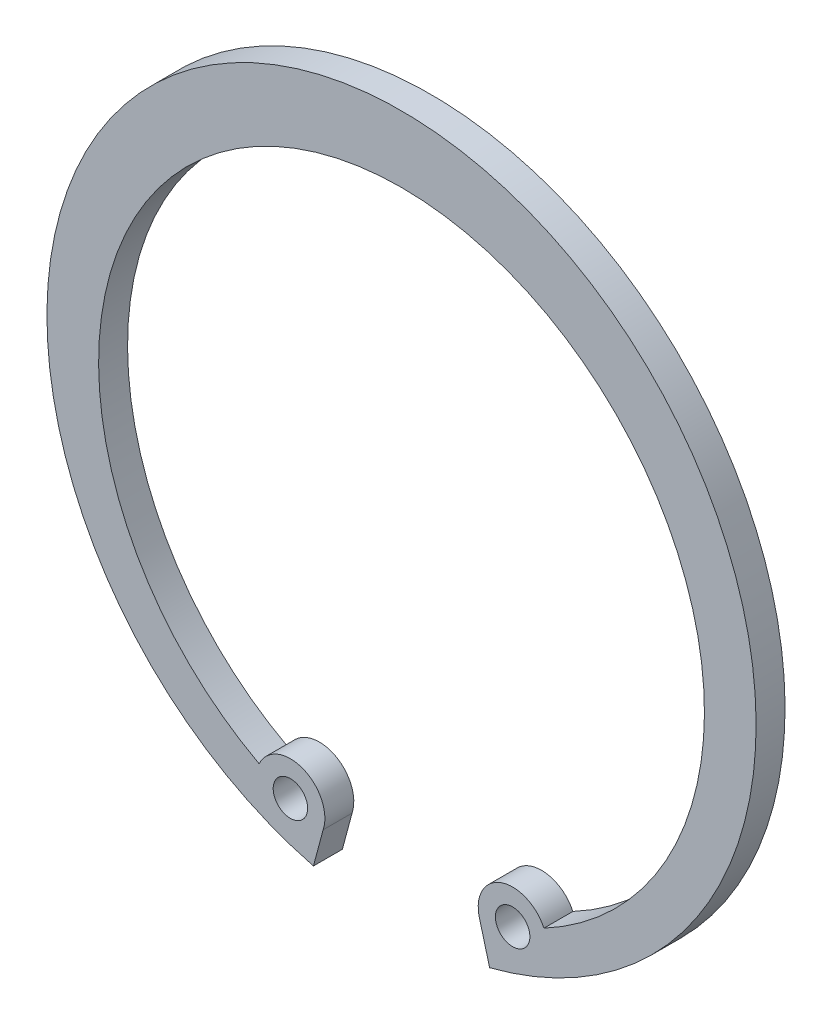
ISO-10303-21;
HEADER;
FILE_DESCRIPTION(('STEP AP214'),'2;1');
FILE_NAME('part.step','',(''),(''),'','','');
FILE_SCHEMA(('AUTOMOTIVE_DESIGN { 1 0 10303 214 1 1 1 1 }'));
ENDSEC;
DATA;
#1=APPLICATION_CONTEXT('core data for automotive mechanical design processes');
#2=APPLICATION_PROTOCOL_DEFINITION('international standard','automotive_design',2000,#1);
#3=PRODUCT_CONTEXT('',#1,'mechanical');
#4=PRODUCT('Part','Part','',(#3));
#5=PRODUCT_RELATED_PRODUCT_CATEGORY('part','',(#4));
#6=PRODUCT_DEFINITION_FORMATION('','',#4);
#7=PRODUCT_DEFINITION_CONTEXT('part definition',#1,'design');
#8=PRODUCT_DEFINITION('design','',#6,#7);
#9=PRODUCT_DEFINITION_SHAPE('','',#8);
#10=(LENGTH_UNIT() NAMED_UNIT(*) SI_UNIT(.MILLI.,.METRE.));
#11=(NAMED_UNIT(*) PLANE_ANGLE_UNIT() SI_UNIT($,.RADIAN.));
#12=(NAMED_UNIT(*) SI_UNIT($,.STERADIAN.) SOLID_ANGLE_UNIT());
#13=UNCERTAINTY_MEASURE_WITH_UNIT(LENGTH_MEASURE(1.E-05),#10,'distance_accuracy_value','');
#14=(GEOMETRIC_REPRESENTATION_CONTEXT(3) GLOBAL_UNCERTAINTY_ASSIGNED_CONTEXT((#13)) GLOBAL_UNIT_ASSIGNED_CONTEXT((#10,
#11,#12)) REPRESENTATION_CONTEXT('',''));
#15=CARTESIAN_POINT('',(0.,0.,0.));
#16=DIRECTION('',(0.,0.,1.));
#17=DIRECTION('',(1.,0.,0.));
#18=AXIS2_PLACEMENT_3D('',#15,#16,#17);
#19=CARTESIAN_POINT('',(0.,0.,1.2));
#20=DIRECTION('',(0.,0.,1.));
#21=DIRECTION('',(1.,0.,0.));
#22=AXIS2_PLACEMENT_3D('',#19,#20,#21);
#23=PLANE('',#22);
#24=CARTESIAN_POINT('',(4.606367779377,-11.68260551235,1.2));
#25=DIRECTION('',(0.,0.,1.));
#26=DIRECTION('',(1.,0.,0.));
#27=AXIS2_PLACEMENT_3D('',#24,#25,#26);
#28=CIRCLE('',#27,0.7140194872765);
#29=CARTESIAN_POINT('',(5.3203872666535,-11.68260551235,1.2));
#30=VERTEX_POINT('',#29);
#31=EDGE_CURVE('E108',#30,#30,#28,.F.);
#32=ORIENTED_EDGE('',*,*,#31,.T.);
#33=EDGE_LOOP('',(#32));
#34=FACE_BOUND('',#33,.T.);
#35=CARTESIAN_POINT('',(-4.606367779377,-11.68260551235,1.2));
#36=DIRECTION('',(0.,0.,1.));
#37=DIRECTION('',(1.,0.,0.));
#38=AXIS2_PLACEMENT_3D('',#35,#36,#37);
#39=CIRCLE('',#38,0.7140194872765);
#40=CARTESIAN_POINT('',(-3.8923482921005,-11.68260551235,1.2));
#41=VERTEX_POINT('',#40);
#42=EDGE_CURVE('E111',#41,#41,#39,.F.);
#43=ORIENTED_EDGE('',*,*,#42,.T.);
#44=EDGE_LOOP('',(#43));
#45=FACE_BOUND('',#44,.T.);
#46=CARTESIAN_POINT('',(-4.606367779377,-11.68260551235,1.2));
#47=DIRECTION('',(0.,0.,1.));
#48=DIRECTION('',(1.,0.,0.));
#49=AXIS2_PLACEMENT_3D('',#46,#47,#48);
#50=CIRCLE('',#49,1.428038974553);
#51=CARTESIAN_POINT('',(-5.90293465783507,-11.0840993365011,1.2));
#52=VERTEX_POINT('',#51);
#53=CARTESIAN_POINT('',(-3.25023443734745,-12.1300400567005,1.2));
#54=VERTEX_POINT('',#53);
#55=EDGE_CURVE('E20',#52,#54,#50,.F.);
#56=ORIENTED_EDGE('',*,*,#55,.F.);
#57=CARTESIAN_POINT('',(0.,0.,1.2));
#58=DIRECTION('',(0.,0.,1.));
#59=DIRECTION('',(1.,0.,0.));
#60=AXIS2_PLACEMENT_3D('',#57,#58,#59);
#61=CIRCLE('',#60,12.55794153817);
#62=CARTESIAN_POINT('',(5.90293465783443,-11.0840993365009,1.2));
#63=VERTEX_POINT('',#62);
#64=EDGE_CURVE('E71',#52,#63,#61,.F.);
#65=ORIENTED_EDGE('',*,*,#64,.T.);
#66=CARTESIAN_POINT('',(4.606367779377,-11.68260551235,1.2));
#67=DIRECTION('',(0.,0.,1.));
#68=DIRECTION('',(1.,0.,0.));
#69=AXIS2_PLACEMENT_3D('',#66,#67,#68);
#70=CIRCLE('',#69,1.428038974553);
#71=CARTESIAN_POINT('',(3.25023443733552,-12.1300400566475,1.2));
#72=VERTEX_POINT('',#71);
#73=EDGE_CURVE('E84',#72,#63,#70,.F.);
#74=ORIENTED_EDGE('',*,*,#73,.F.);
#75=DIRECTION('',(-0.258819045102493,0.965925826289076,0.));
#76=VECTOR('',#75,1.);
#77=CARTESIAN_POINT('',(3.250234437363,-12.13004005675,1.2));
#78=LINE('',#77,#76);
#79=CARTESIAN_POINT('',(3.65207040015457,-13.6297122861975,1.2));
#80=VERTEX_POINT('',#79);
#81=EDGE_CURVE('E94',#72,#80,#78,.F.);
#82=ORIENTED_EDGE('',*,*,#81,.T.);
#83=CARTESIAN_POINT('',(0.,0.6094022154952,1.2));
#84=DIRECTION('',(0.,0.,1.));
#85=DIRECTION('',(1.,0.,0.));
#86=AXIS2_PLACEMENT_3D('',#83,#84,#85);
#87=CIRCLE('',#86,14.7);
#88=CARTESIAN_POINT('',(-3.65207040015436,-13.6297122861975,1.2));
#89=VERTEX_POINT('',#88);
#90=EDGE_CURVE('E114',#89,#80,#87,.F.);
#91=ORIENTED_EDGE('',*,*,#90,.F.);
#92=DIRECTION('',(-0.258819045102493,-0.965925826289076,0.));
#93=VECTOR('',#92,1.);
#94=CARTESIAN_POINT('',(-3.652070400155,-13.6297122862,1.2));
#95=LINE('',#94,#93);
#96=EDGE_CURVE('E74',#89,#54,#95,.F.);
#97=ORIENTED_EDGE('',*,*,#96,.T.);
#98=EDGE_LOOP('',(#56,#65,#74,#82,#91,#97));
#99=FACE_BOUND('',#98,.T.);
#100=ADVANCED_FACE('F16',(#34,#45,#99),#23,.T.);
#101=CARTESIAN_POINT('',(-3.652070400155,-13.6297122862,0.));
#102=DIRECTION('',(-0.965925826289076,0.258819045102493,0.));
#103=DIRECTION('',(-0.258819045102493,-0.965925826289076,0.));
#104=AXIS2_PLACEMENT_3D('',#101,#102,#103);
#105=PLANE('',#104);
#106=DIRECTION('',(0.,0.,1.));
#107=VECTOR('',#106,1.);
#108=CARTESIAN_POINT('',(-3.65207040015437,-13.6297122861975,0.));
#109=LINE('',#108,#107);
#110=CARTESIAN_POINT('',(-3.65207040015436,-13.6297122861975,0.));
#111=VERTEX_POINT('',#110);
#112=EDGE_CURVE('E116',#111,#89,#109,.T.);
#113=ORIENTED_EDGE('',*,*,#112,.F.);
#114=DIRECTION('',(0.258819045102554,0.965925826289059,0.));
#115=VECTOR('',#114,1.);
#116=CARTESIAN_POINT('',(-3.652070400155,-13.6297122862,0.));
#117=LINE('',#116,#115);
#118=CARTESIAN_POINT('',(-3.25023443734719,-12.1300400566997,0.));
#119=VERTEX_POINT('',#118);
#120=EDGE_CURVE('E107',#111,#119,#117,.T.);
#121=ORIENTED_EDGE('',*,*,#120,.T.);
#122=DIRECTION('',(0.,0.,1.));
#123=VECTOR('',#122,1.);
#124=CARTESIAN_POINT('',(-3.25023443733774,-12.1300400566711,0.));
#125=LINE('',#124,#123);
#126=EDGE_CURVE('E76',#54,#119,#125,.F.);
#127=ORIENTED_EDGE('',*,*,#126,.F.);
#128=ORIENTED_EDGE('',*,*,#96,.F.);
#129=EDGE_LOOP('',(#113,#121,#127,#128));
#130=FACE_BOUND('',#129,.T.);
#131=ADVANCED_FACE('F137',(#130),#105,.F.);
#132=CARTESIAN_POINT('',(-4.606367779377,-11.68260551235,0.));
#133=DIRECTION('',(0.,0.,1.));
#134=DIRECTION('',(1.,0.,0.));
#135=AXIS2_PLACEMENT_3D('',#132,#133,#134);
#136=CYLINDRICAL_SURFACE('',#135,1.428038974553);
#137=CARTESIAN_POINT('',(-4.606367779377,-11.68260551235,0.));
#138=DIRECTION('',(0.,0.,1.));
#139=DIRECTION('',(1.,0.,0.));
#140=AXIS2_PLACEMENT_3D('',#137,#138,#139);
#141=CIRCLE('',#140,1.428038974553);
#142=CARTESIAN_POINT('',(-5.90293465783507,-11.0840993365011,0.));
#143=VERTEX_POINT('',#142);
#144=EDGE_CURVE('E87',#119,#143,#141,.T.);
#145=ORIENTED_EDGE('',*,*,#144,.T.);
#146=DIRECTION('',(0.,0.,1.));
#147=VECTOR('',#146,1.);
#148=CARTESIAN_POINT('',(-5.90293465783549,-11.0840993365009,0.));
#149=LINE('',#148,#147);
#150=EDGE_CURVE('E80',#143,#52,#149,.T.);
#151=ORIENTED_EDGE('',*,*,#150,.T.);
#152=ORIENTED_EDGE('',*,*,#55,.T.);
#153=ORIENTED_EDGE('',*,*,#126,.T.);
#154=EDGE_LOOP('',(#145,#151,#152,#153));
#155=FACE_BOUND('',#154,.T.);
#156=ADVANCED_FACE('F85',(#155),#136,.T.);
#157=CARTESIAN_POINT('',(0.,0.,0.));
#158=DIRECTION('',(0.,0.,1.));
#159=DIRECTION('',(1.,0.,0.));
#160=AXIS2_PLACEMENT_3D('',#157,#158,#159);
#161=CYLINDRICAL_SURFACE('',#160,12.55794153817);
#162=ORIENTED_EDGE('',*,*,#64,.F.);
#163=ORIENTED_EDGE('',*,*,#150,.F.);
#164=CARTESIAN_POINT('',(0.,0.,0.));
#165=DIRECTION('',(0.,0.,1.));
#166=DIRECTION('',(1.,0.,0.));
#167=AXIS2_PLACEMENT_3D('',#164,#165,#166);
#168=CIRCLE('',#167,12.55794153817);
#169=CARTESIAN_POINT('',(5.90293465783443,-11.0840993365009,0.));
#170=VERTEX_POINT('',#169);
#171=EDGE_CURVE('E104',#143,#170,#168,.F.);
#172=ORIENTED_EDGE('',*,*,#171,.T.);
#173=DIRECTION('',(0.,0.,1.));
#174=VECTOR('',#173,1.);
#175=CARTESIAN_POINT('',(5.9029346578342,-11.0840993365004,0.));
#176=LINE('',#175,#174);
#177=EDGE_CURVE('E83',#63,#170,#176,.F.);
#178=ORIENTED_EDGE('',*,*,#177,.F.);
#179=EDGE_LOOP('',(#162,#163,#172,#178));
#180=FACE_BOUND('',#179,.T.);
#181=ADVANCED_FACE('F79',(#180),#161,.F.);
#182=CARTESIAN_POINT('',(4.606367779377,-11.68260551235,0.));
#183=DIRECTION('',(0.,0.,1.));
#184=DIRECTION('',(1.,0.,0.));
#185=AXIS2_PLACEMENT_3D('',#182,#183,#184);
#186=CYLINDRICAL_SURFACE('',#185,1.428038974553);
#187=CARTESIAN_POINT('',(4.606367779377,-11.68260551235,0.));
#188=DIRECTION('',(0.,0.,1.));
#189=DIRECTION('',(1.,0.,0.));
#190=AXIS2_PLACEMENT_3D('',#187,#188,#189);
#191=CIRCLE('',#190,1.428038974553);
#192=CARTESIAN_POINT('',(3.25023443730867,-12.1300400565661,0.));
#193=VERTEX_POINT('',#192);
#194=EDGE_CURVE('E102',#170,#193,#191,.T.);
#195=ORIENTED_EDGE('',*,*,#194,.T.);
#196=DIRECTION('',(0.,0.,1.));
#197=VECTOR('',#196,1.);
#198=CARTESIAN_POINT('',(3.25023443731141,-12.1300400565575,0.));
#199=LINE('',#198,#197);
#200=EDGE_CURVE('E95',#193,#72,#199,.T.);
#201=ORIENTED_EDGE('',*,*,#200,.T.);
#202=ORIENTED_EDGE('',*,*,#73,.T.);
#203=ORIENTED_EDGE('',*,*,#177,.T.);
#204=EDGE_LOOP('',(#195,#201,#202,#203));
#205=FACE_BOUND('',#204,.T.);
#206=ADVANCED_FACE('F171',(#205),#186,.T.);
#207=CARTESIAN_POINT('',(3.250234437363,-12.13004005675,0.));
#208=DIRECTION('',(0.965925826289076,0.258819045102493,0.));
#209=DIRECTION('',(-0.258819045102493,0.965925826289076,0.));
#210=AXIS2_PLACEMENT_3D('',#207,#208,#209);
#211=PLANE('',#210);
#212=DIRECTION('',(0.,0.,1.));
#213=VECTOR('',#212,1.);
#214=CARTESIAN_POINT('',(3.65207040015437,-13.6297122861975,0.));
#215=LINE('',#214,#213);
#216=CARTESIAN_POINT('',(3.65207040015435,-13.6297122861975,0.));
#217=VERTEX_POINT('',#216);
#218=EDGE_CURVE('E35',#80,#217,#215,.F.);
#219=ORIENTED_EDGE('',*,*,#218,.F.);
#220=ORIENTED_EDGE('',*,*,#81,.F.);
#221=ORIENTED_EDGE('',*,*,#200,.F.);
#222=DIRECTION('',(0.258819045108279,-0.965925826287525,0.));
#223=VECTOR('',#222,1.);
#224=CARTESIAN_POINT('',(3.250234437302,-12.13004005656,0.));
#225=LINE('',#224,#223);
#226=EDGE_CURVE('E101',#193,#217,#225,.T.);
#227=ORIENTED_EDGE('',*,*,#226,.T.);
#228=EDGE_LOOP('',(#219,#220,#221,#227));
#229=FACE_BOUND('',#228,.T.);
#230=ADVANCED_FACE('F130',(#229),#211,.F.);
#231=CARTESIAN_POINT('',(0.,0.6094022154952,0.));
#232=DIRECTION('',(0.,0.,1.));
#233=DIRECTION('',(1.,0.,0.));
#234=AXIS2_PLACEMENT_3D('',#231,#232,#233);
#235=CYLINDRICAL_SURFACE('',#234,14.7);
#236=ORIENTED_EDGE('',*,*,#112,.T.);
#237=ORIENTED_EDGE('',*,*,#90,.T.);
#238=ORIENTED_EDGE('',*,*,#218,.T.);
#239=CARTESIAN_POINT('',(0.,0.6094022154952,0.));
#240=DIRECTION('',(0.,0.,1.));
#241=DIRECTION('',(1.,0.,0.));
#242=AXIS2_PLACEMENT_3D('',#239,#240,#241);
#243=CIRCLE('',#242,14.7);
#244=EDGE_CURVE('E99',#217,#111,#243,.T.);
#245=ORIENTED_EDGE('',*,*,#244,.T.);
#246=EDGE_LOOP('',(#236,#237,#238,#245));
#247=FACE_BOUND('',#246,.T.);
#248=ADVANCED_FACE('F135',(#247),#235,.T.);
#249=CARTESIAN_POINT('',(-4.606367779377,-11.68260551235,1.2));
#250=DIRECTION('',(0.,0.,1.));
#251=DIRECTION('',(1.,0.,0.));
#252=AXIS2_PLACEMENT_3D('',#249,#250,#251);
#253=CYLINDRICAL_SURFACE('',#252,0.7140194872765);
#254=ORIENTED_EDGE('',*,*,#42,.F.);
#255=EDGE_LOOP('',(#254));
#256=FACE_BOUND('',#255,.T.);
#257=CARTESIAN_POINT('',(-4.606367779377,-11.68260551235,0.));
#258=DIRECTION('',(0.,0.,1.));
#259=DIRECTION('',(1.,0.,0.));
#260=AXIS2_PLACEMENT_3D('',#257,#258,#259);
#261=CIRCLE('',#260,0.7140194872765);
#262=CARTESIAN_POINT('',(-3.8923482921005,-11.68260551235,0.));
#263=VERTEX_POINT('',#262);
#264=EDGE_CURVE('E26',#263,#263,#261,.F.);
#265=ORIENTED_EDGE('',*,*,#264,.T.);
#266=EDGE_LOOP('',(#265));
#267=FACE_BOUND('',#266,.T.);
#268=ADVANCED_FACE('F154',(#256,#267),#253,.F.);
#269=CARTESIAN_POINT('',(4.606367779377,-11.68260551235,1.2));
#270=DIRECTION('',(0.,0.,1.));
#271=DIRECTION('',(1.,0.,0.));
#272=AXIS2_PLACEMENT_3D('',#269,#270,#271);
#273=CYLINDRICAL_SURFACE('',#272,0.7140194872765);
#274=ORIENTED_EDGE('',*,*,#31,.F.);
#275=EDGE_LOOP('',(#274));
#276=FACE_BOUND('',#275,.T.);
#277=CARTESIAN_POINT('',(4.606367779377,-11.68260551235,0.));
#278=DIRECTION('',(0.,0.,1.));
#279=DIRECTION('',(1.,0.,0.));
#280=AXIS2_PLACEMENT_3D('',#277,#278,#279);
#281=CIRCLE('',#280,0.7140194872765);
#282=CARTESIAN_POINT('',(5.3203872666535,-11.68260551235,0.));
#283=VERTEX_POINT('',#282);
#284=EDGE_CURVE('E11',#283,#283,#281,.F.);
#285=ORIENTED_EDGE('',*,*,#284,.T.);
#286=EDGE_LOOP('',(#285));
#287=FACE_BOUND('',#286,.T.);
#288=ADVANCED_FACE('F149',(#276,#287),#273,.F.);
#289=CARTESIAN_POINT('',(0.,0.,0.));
#290=DIRECTION('',(0.,0.,1.));
#291=DIRECTION('',(1.,0.,0.));
#292=AXIS2_PLACEMENT_3D('',#289,#290,#291);
#293=PLANE('',#292);
#294=ORIENTED_EDGE('',*,*,#284,.F.);
#295=EDGE_LOOP('',(#294));
#296=FACE_BOUND('',#295,.T.);
#297=ORIENTED_EDGE('',*,*,#264,.F.);
#298=EDGE_LOOP('',(#297));
#299=FACE_BOUND('',#298,.T.);
#300=ORIENTED_EDGE('',*,*,#120,.F.);
#301=ORIENTED_EDGE('',*,*,#244,.F.);
#302=ORIENTED_EDGE('',*,*,#226,.F.);
#303=ORIENTED_EDGE('',*,*,#194,.F.);
#304=ORIENTED_EDGE('',*,*,#171,.F.);
#305=ORIENTED_EDGE('',*,*,#144,.F.);
#306=EDGE_LOOP('',(#300,#301,#302,#303,#304,#305));
#307=FACE_BOUND('',#306,.T.);
#308=ADVANCED_FACE('F18',(#296,#299,#307),#293,.F.);
#309=CLOSED_SHELL('',(#100,#131,#156,#181,#206,#230,#248,#268,#288,#308));
#310=MANIFOLD_SOLID_BREP('B1',#309);
#311=ADVANCED_BREP_SHAPE_REPRESENTATION('',(#18,#310),#14);
#312=SHAPE_DEFINITION_REPRESENTATION(#9,#311);
ENDSEC;
END-ISO-10303-21;
